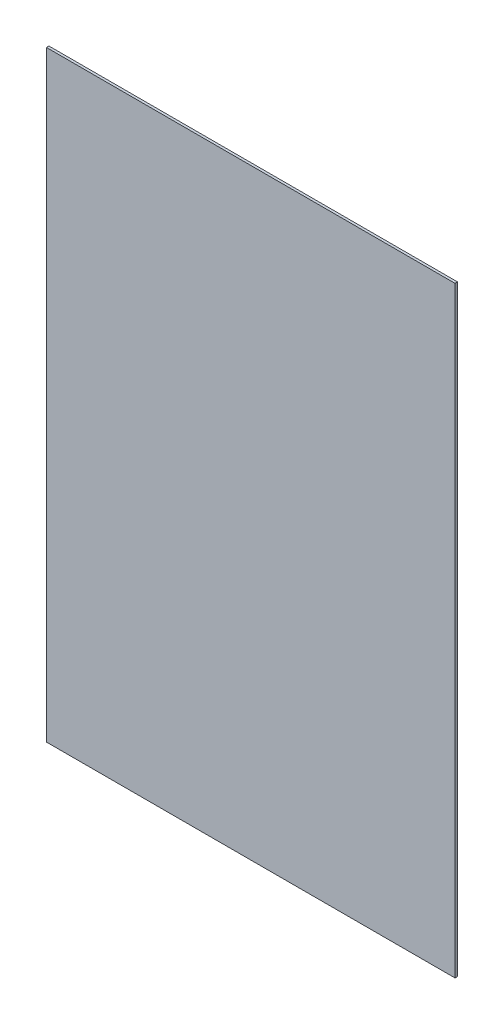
ISO-10303-21;
HEADER;
FILE_DESCRIPTION(('STEP AP214'),'2;1');
FILE_NAME('part.step','',(''),(''),'','','');
FILE_SCHEMA(('AUTOMOTIVE_DESIGN { 1 0 10303 214 1 1 1 1 }'));
ENDSEC;
DATA;
#1=APPLICATION_CONTEXT('core data for automotive mechanical design processes');
#2=APPLICATION_PROTOCOL_DEFINITION('international standard','automotive_design',2000,#1);
#3=PRODUCT_CONTEXT('',#1,'mechanical');
#4=PRODUCT('Part','Part','',(#3));
#5=PRODUCT_RELATED_PRODUCT_CATEGORY('part','',(#4));
#6=PRODUCT_DEFINITION_FORMATION('','',#4);
#7=PRODUCT_DEFINITION_CONTEXT('part definition',#1,'design');
#8=PRODUCT_DEFINITION('design','',#6,#7);
#9=PRODUCT_DEFINITION_SHAPE('','',#8);
#10=(LENGTH_UNIT() NAMED_UNIT(*) SI_UNIT(.MILLI.,.METRE.));
#11=(NAMED_UNIT(*) PLANE_ANGLE_UNIT() SI_UNIT($,.RADIAN.));
#12=(NAMED_UNIT(*) SI_UNIT($,.STERADIAN.) SOLID_ANGLE_UNIT());
#13=UNCERTAINTY_MEASURE_WITH_UNIT(LENGTH_MEASURE(1.E-05),#10,'distance_accuracy_value','');
#14=(GEOMETRIC_REPRESENTATION_CONTEXT(3) GLOBAL_UNCERTAINTY_ASSIGNED_CONTEXT((#13)) GLOBAL_UNIT_ASSIGNED_CONTEXT((#10,
#11,#12)) REPRESENTATION_CONTEXT('',''));
#15=CARTESIAN_POINT('',(0.,0.,0.));
#16=DIRECTION('',(0.,0.,1.));
#17=DIRECTION('',(1.,0.,0.));
#18=AXIS2_PLACEMENT_3D('',#15,#16,#17);
#19=CARTESIAN_POINT('',(457.2,-609.6,2.794));
#20=DIRECTION('',(-1.,0.,0.));
#21=DIRECTION('',(0.,0.,1.));
#22=AXIS2_PLACEMENT_3D('',#19,#20,#21);
#23=PLANE('',#22);
#24=DIRECTION('',(0.,1.,0.));
#25=VECTOR('',#24,1.);
#26=CARTESIAN_POINT('',(457.2,-609.6,-2.794));
#27=LINE('',#26,#25);
#28=CARTESIAN_POINT('',(457.2,-609.6,-2.794));
#29=VERTEX_POINT('',#28);
#30=CARTESIAN_POINT('',(457.2,736.6,-2.794));
#31=VERTEX_POINT('',#30);
#32=EDGE_CURVE('E84',#29,#31,#27,.T.);
#33=ORIENTED_EDGE('',*,*,#32,.T.);
#34=DIRECTION('',(0.,0.,-1.));
#35=VECTOR('',#34,1.);
#36=CARTESIAN_POINT('',(457.2,736.6,2.794));
#37=LINE('',#36,#35);
#38=CARTESIAN_POINT('',(457.2,736.6,2.794));
#39=VERTEX_POINT('',#38);
#40=EDGE_CURVE('E87',#39,#31,#37,.T.);
#41=ORIENTED_EDGE('',*,*,#40,.F.);
#42=DIRECTION('',(0.,1.,0.));
#43=VECTOR('',#42,1.);
#44=CARTESIAN_POINT('',(457.2,-609.6,2.794));
#45=LINE('',#44,#43);
#46=CARTESIAN_POINT('',(457.2,-609.6,2.794));
#47=VERTEX_POINT('',#46);
#48=EDGE_CURVE('E71',#47,#39,#45,.T.);
#49=ORIENTED_EDGE('',*,*,#48,.F.);
#50=DIRECTION('',(0.,0.,-1.));
#51=VECTOR('',#50,1.);
#52=CARTESIAN_POINT('',(457.2,-609.6,2.794));
#53=LINE('',#52,#51);
#54=EDGE_CURVE('E47',#47,#29,#53,.T.);
#55=ORIENTED_EDGE('',*,*,#54,.T.);
#56=EDGE_LOOP('',(#33,#41,#49,#55));
#57=FACE_BOUND('',#56,.T.);
#58=ADVANCED_FACE('F39',(#57),#23,.F.);
#59=CARTESIAN_POINT('',(-457.2,-609.6,2.794));
#60=DIRECTION('',(1.,0.,0.));
#61=DIRECTION('',(0.,0.,-1.));
#62=AXIS2_PLACEMENT_3D('',#59,#60,#61);
#63=PLANE('',#62);
#64=DIRECTION('',(0.,-1.,0.));
#65=VECTOR('',#64,1.);
#66=CARTESIAN_POINT('',(-457.2,-609.6,-2.794));
#67=LINE('',#66,#65);
#68=CARTESIAN_POINT('',(-457.2,736.6,-2.794));
#69=VERTEX_POINT('',#68);
#70=CARTESIAN_POINT('',(-457.2,-609.6,-2.794));
#71=VERTEX_POINT('',#70);
#72=EDGE_CURVE('E66',#69,#71,#67,.T.);
#73=ORIENTED_EDGE('',*,*,#72,.T.);
#74=DIRECTION('',(0.,0.,-1.));
#75=VECTOR('',#74,1.);
#76=CARTESIAN_POINT('',(-457.2,-609.6,2.794));
#77=LINE('',#76,#75);
#78=CARTESIAN_POINT('',(-457.2,-609.6,2.794));
#79=VERTEX_POINT('',#78);
#80=EDGE_CURVE('E11',#79,#71,#77,.T.);
#81=ORIENTED_EDGE('',*,*,#80,.F.);
#82=DIRECTION('',(0.,-1.,0.));
#83=VECTOR('',#82,1.);
#84=CARTESIAN_POINT('',(-457.2,-609.6,2.794));
#85=LINE('',#84,#83);
#86=CARTESIAN_POINT('',(-457.2,736.6,2.794));
#87=VERTEX_POINT('',#86);
#88=EDGE_CURVE('E105',#87,#79,#85,.T.);
#89=ORIENTED_EDGE('',*,*,#88,.F.);
#90=DIRECTION('',(0.,0.,1.));
#91=VECTOR('',#90,1.);
#92=CARTESIAN_POINT('',(-457.2,736.6,-2.794));
#93=LINE('',#92,#91);
#94=EDGE_CURVE('E97',#69,#87,#93,.T.);
#95=ORIENTED_EDGE('',*,*,#94,.F.);
#96=EDGE_LOOP('',(#73,#81,#89,#95));
#97=FACE_BOUND('',#96,.T.);
#98=ADVANCED_FACE('F112',(#97),#63,.F.);
#99=CARTESIAN_POINT('',(-457.2,-609.6,2.794));
#100=DIRECTION('',(0.,1.,0.));
#101=DIRECTION('',(0.,0.,1.));
#102=AXIS2_PLACEMENT_3D('',#99,#100,#101);
#103=PLANE('',#102);
#104=DIRECTION('',(1.,0.,0.));
#105=VECTOR('',#104,1.);
#106=CARTESIAN_POINT('',(-457.2,-609.6,-2.794));
#107=LINE('',#106,#105);
#108=EDGE_CURVE('E106',#71,#29,#107,.T.);
#109=ORIENTED_EDGE('',*,*,#108,.T.);
#110=ORIENTED_EDGE('',*,*,#54,.F.);
#111=DIRECTION('',(1.,0.,0.));
#112=VECTOR('',#111,1.);
#113=CARTESIAN_POINT('',(-457.2,-609.6,2.794));
#114=LINE('',#113,#112);
#115=EDGE_CURVE('E55',#79,#47,#114,.T.);
#116=ORIENTED_EDGE('',*,*,#115,.F.);
#117=ORIENTED_EDGE('',*,*,#80,.T.);
#118=EDGE_LOOP('',(#109,#110,#116,#117));
#119=FACE_BOUND('',#118,.T.);
#120=ADVANCED_FACE('F111',(#119),#103,.F.);
#121=CARTESIAN_POINT('',(0.,0.,2.794));
#122=DIRECTION('',(0.,0.,-1.));
#123=DIRECTION('',(-1.,0.,0.));
#124=AXIS2_PLACEMENT_3D('',#121,#122,#123);
#125=PLANE('',#124);
#126=ORIENTED_EDGE('',*,*,#48,.T.);
#127=DIRECTION('',(1.,0.,0.));
#128=VECTOR('',#127,1.);
#129=CARTESIAN_POINT('',(-457.2,736.6,2.794));
#130=LINE('',#129,#128);
#131=EDGE_CURVE('E90',#87,#39,#130,.T.);
#132=ORIENTED_EDGE('',*,*,#131,.F.);
#133=ORIENTED_EDGE('',*,*,#88,.T.);
#134=ORIENTED_EDGE('',*,*,#115,.T.);
#135=EDGE_LOOP('',(#126,#132,#133,#134));
#136=FACE_BOUND('',#135,.T.);
#137=ADVANCED_FACE('F113',(#136),#125,.F.);
#138=CARTESIAN_POINT('',(0.,0.,-2.794));
#139=DIRECTION('',(0.,0.,-1.));
#140=DIRECTION('',(-1.,0.,0.));
#141=AXIS2_PLACEMENT_3D('',#138,#139,#140);
#142=PLANE('',#141);
#143=ORIENTED_EDGE('',*,*,#32,.F.);
#144=ORIENTED_EDGE('',*,*,#108,.F.);
#145=ORIENTED_EDGE('',*,*,#72,.F.);
#146=DIRECTION('',(-1.,0.,0.));
#147=VECTOR('',#146,1.);
#148=CARTESIAN_POINT('',(457.2,736.6,-2.794));
#149=LINE('',#148,#147);
#150=EDGE_CURVE('E93',#31,#69,#149,.T.);
#151=ORIENTED_EDGE('',*,*,#150,.F.);
#152=EDGE_LOOP('',(#143,#144,#145,#151));
#153=FACE_BOUND('',#152,.T.);
#154=ADVANCED_FACE('F94',(#153),#142,.T.);
#155=CARTESIAN_POINT('',(0.,736.6,0.));
#156=DIRECTION('',(0.,1.,0.));
#157=DIRECTION('',(0.,0.,1.));
#158=AXIS2_PLACEMENT_3D('',#155,#156,#157);
#159=PLANE('',#158);
#160=ORIENTED_EDGE('',*,*,#40,.T.);
#161=ORIENTED_EDGE('',*,*,#150,.T.);
#162=ORIENTED_EDGE('',*,*,#94,.T.);
#163=ORIENTED_EDGE('',*,*,#131,.T.);
#164=EDGE_LOOP('',(#160,#161,#162,#163));
#165=FACE_BOUND('',#164,.T.);
#166=ADVANCED_FACE('F99',(#165),#159,.T.);
#167=CLOSED_SHELL('',(#58,#98,#120,#137,#154,#166));
#168=MANIFOLD_SOLID_BREP('B2',#167);
#169=ADVANCED_BREP_SHAPE_REPRESENTATION('',(#18,#168),#14);
#170=SHAPE_DEFINITION_REPRESENTATION(#9,#169);
ENDSEC;
END-ISO-10303-21;
